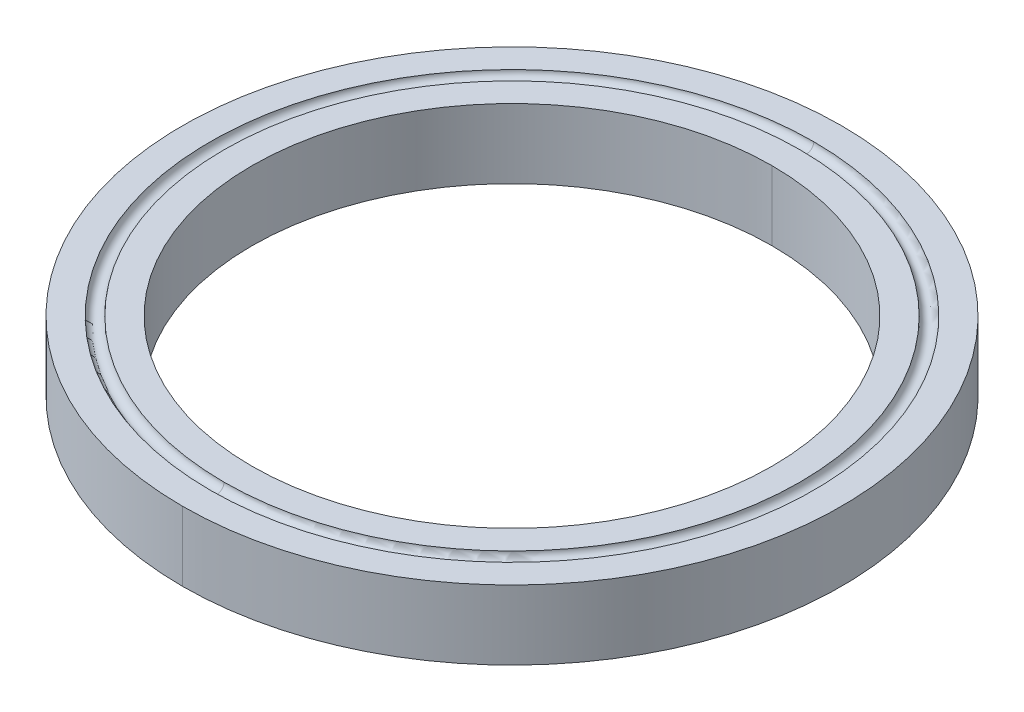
ISO-10303-21;
HEADER;
FILE_DESCRIPTION(('STEP AP214'),'2;1');
FILE_NAME('part.step','',(''),(''),'','','');
FILE_SCHEMA(('AUTOMOTIVE_DESIGN { 1 0 10303 214 1 1 1 1 }'));
ENDSEC;
DATA;
#1=APPLICATION_CONTEXT('core data for automotive mechanical design processes');
#2=APPLICATION_PROTOCOL_DEFINITION('international standard','automotive_design',2000,#1);
#3=PRODUCT_CONTEXT('',#1,'mechanical');
#4=PRODUCT('Part','Part','',(#3));
#5=PRODUCT_RELATED_PRODUCT_CATEGORY('part','',(#4));
#6=PRODUCT_DEFINITION_FORMATION('','',#4);
#7=PRODUCT_DEFINITION_CONTEXT('part definition',#1,'design');
#8=PRODUCT_DEFINITION('design','',#6,#7);
#9=PRODUCT_DEFINITION_SHAPE('','',#8);
#10=(LENGTH_UNIT() NAMED_UNIT(*) SI_UNIT(.MILLI.,.METRE.));
#11=(NAMED_UNIT(*) PLANE_ANGLE_UNIT() SI_UNIT($,.RADIAN.));
#12=(NAMED_UNIT(*) SI_UNIT($,.STERADIAN.) SOLID_ANGLE_UNIT());
#13=UNCERTAINTY_MEASURE_WITH_UNIT(LENGTH_MEASURE(1.E-05),#10,'distance_accuracy_value','');
#14=(GEOMETRIC_REPRESENTATION_CONTEXT(3) GLOBAL_UNCERTAINTY_ASSIGNED_CONTEXT((#13)) GLOBAL_UNIT_ASSIGNED_CONTEXT((#10,
#11,#12)) REPRESENTATION_CONTEXT('',''));
#15=CARTESIAN_POINT('',(0.,0.,0.));
#16=DIRECTION('',(0.,0.,1.));
#17=DIRECTION('',(1.,0.,0.));
#18=AXIS2_PLACEMENT_3D('',#15,#16,#17);
#19=CARTESIAN_POINT('',(43.5,0.,0.));
#20=DIRECTION('',(0.,-1.,0.));
#21=DIRECTION('',(0.,0.,-1.));
#22=AXIS2_PLACEMENT_3D('',#19,#20,#21);
#23=PLANE('',#22);
#24=CARTESIAN_POINT('',(0.,0.,0.));
#25=DIRECTION('',(0.,-1.,0.));
#26=DIRECTION('',(0.,0.,1.));
#27=AXIS2_PLACEMENT_3D('',#24,#25,#26);
#28=CIRCLE('',#27,43.5);
#29=CARTESIAN_POINT('',(0.,0.,43.5));
#30=VERTEX_POINT('',#29);
#31=CARTESIAN_POINT('',(0.,0.,-43.5));
#32=VERTEX_POINT('',#31);
#33=EDGE_CURVE('E11',#30,#32,#28,.T.);
#34=ORIENTED_EDGE('',*,*,#33,.T.);
#35=CARTESIAN_POINT('',(0.,0.,0.));
#36=DIRECTION('',(0.,-1.,0.));
#37=DIRECTION('',(0.,0.,-1.));
#38=AXIS2_PLACEMENT_3D('',#35,#36,#37);
#39=CIRCLE('',#38,43.5);
#40=EDGE_CURVE('E176',#32,#30,#39,.T.);
#41=ORIENTED_EDGE('',*,*,#40,.T.);
#42=EDGE_LOOP('',(#34,#41));
#43=FACE_BOUND('',#42,.T.);
#44=CARTESIAN_POINT('',(0.,0.,0.));
#45=DIRECTION('',(0.,1.,0.));
#46=DIRECTION('',(0.,0.,-1.));
#47=AXIS2_PLACEMENT_3D('',#44,#45,#46);
#48=CIRCLE('',#47,47.5);
#49=CARTESIAN_POINT('',(0.,0.,-47.5));
#50=VERTEX_POINT('',#49);
#51=CARTESIAN_POINT('',(0.,0.,47.5));
#52=VERTEX_POINT('',#51);
#53=EDGE_CURVE('E133',#50,#52,#48,.T.);
#54=ORIENTED_EDGE('',*,*,#53,.T.);
#55=CARTESIAN_POINT('',(0.,0.,0.));
#56=DIRECTION('',(0.,1.,0.));
#57=DIRECTION('',(0.,0.,1.));
#58=AXIS2_PLACEMENT_3D('',#55,#56,#57);
#59=CIRCLE('',#58,47.5);
#60=EDGE_CURVE('E136',#52,#50,#59,.T.);
#61=ORIENTED_EDGE('',*,*,#60,.T.);
#62=EDGE_LOOP('',(#54,#61));
#63=FACE_BOUND('',#62,.T.);
#64=ADVANCED_FACE('F17',(#43,#63),#23,.F.);
#65=CARTESIAN_POINT('',(0.,0.,0.));
#66=DIRECTION('',(0.,1.,0.));
#67=DIRECTION('',(0.,0.,1.));
#68=AXIS2_PLACEMENT_3D('',#65,#66,#67);
#69=TOROIDAL_SURFACE('',#68,42.5,1.);
#70=CARTESIAN_POINT('',(0.,0.,-42.5));
#71=DIRECTION('',(-1.,0.,0.));
#72=DIRECTION('',(0.,0.,-1.));
#73=AXIS2_PLACEMENT_3D('',#70,#71,#72);
#74=CIRCLE('',#73,1.);
#75=CARTESIAN_POINT('',(0.,0.,-41.5));
#76=VERTEX_POINT('',#75);
#77=EDGE_CURVE('E28',#32,#76,#74,.T.);
#78=ORIENTED_EDGE('',*,*,#77,.F.);
#79=ORIENTED_EDGE('',*,*,#33,.F.);
#80=CARTESIAN_POINT('',(0.,0.,42.5));
#81=DIRECTION('',(1.,0.,0.));
#82=DIRECTION('',(0.,0.,1.));
#83=AXIS2_PLACEMENT_3D('',#80,#81,#82);
#84=CIRCLE('',#83,1.);
#85=CARTESIAN_POINT('',(0.,0.,41.5));
#86=VERTEX_POINT('',#85);
#87=EDGE_CURVE('E167',#30,#86,#84,.T.);
#88=ORIENTED_EDGE('',*,*,#87,.T.);
#89=CARTESIAN_POINT('',(0.,0.,0.));
#90=DIRECTION('',(0.,1.,0.));
#91=DIRECTION('',(0.,0.,-1.));
#92=AXIS2_PLACEMENT_3D('',#89,#90,#91);
#93=CIRCLE('',#92,41.5);
#94=EDGE_CURVE('E106',#76,#86,#93,.T.);
#95=ORIENTED_EDGE('',*,*,#94,.F.);
#96=EDGE_LOOP('',(#78,#79,#88,#95));
#97=FACE_BOUND('',#96,.T.);
#98=ADVANCED_FACE('F221',(#97),#69,.F.);
#99=CARTESIAN_POINT('',(0.,0.,0.));
#100=DIRECTION('',(0.,1.,0.));
#101=DIRECTION('',(0.,0.,1.));
#102=AXIS2_PLACEMENT_3D('',#99,#100,#101);
#103=TOROIDAL_SURFACE('',#102,42.5,1.);
#104=CARTESIAN_POINT('',(0.,0.,0.));
#105=DIRECTION('',(0.,1.,0.));
#106=DIRECTION('',(0.,0.,1.));
#107=AXIS2_PLACEMENT_3D('',#104,#105,#106);
#108=CIRCLE('',#107,41.5);
#109=EDGE_CURVE('E147',#86,#76,#108,.T.);
#110=ORIENTED_EDGE('',*,*,#109,.F.);
#111=ORIENTED_EDGE('',*,*,#87,.F.);
#112=ORIENTED_EDGE('',*,*,#40,.F.);
#113=ORIENTED_EDGE('',*,*,#77,.T.);
#114=EDGE_LOOP('',(#110,#111,#112,#113));
#115=FACE_BOUND('',#114,.T.);
#116=ADVANCED_FACE('F226',(#115),#103,.F.);
#117=CARTESIAN_POINT('',(37.5,0.,0.));
#118=DIRECTION('',(0.,-1.,0.));
#119=DIRECTION('',(0.,0.,-1.));
#120=AXIS2_PLACEMENT_3D('',#117,#118,#119);
#121=PLANE('',#120);
#122=CARTESIAN_POINT('',(0.,0.,0.));
#123=DIRECTION('',(0.,-1.,0.));
#124=DIRECTION('',(0.,0.,1.));
#125=AXIS2_PLACEMENT_3D('',#122,#123,#124);
#126=CIRCLE('',#125,37.5);
#127=CARTESIAN_POINT('',(0.,0.,37.5));
#128=VERTEX_POINT('',#127);
#129=CARTESIAN_POINT('',(0.,0.,-37.5));
#130=VERTEX_POINT('',#129);
#131=EDGE_CURVE('E97',#128,#130,#126,.T.);
#132=ORIENTED_EDGE('',*,*,#131,.T.);
#133=CARTESIAN_POINT('',(0.,0.,0.));
#134=DIRECTION('',(0.,-1.,0.));
#135=DIRECTION('',(0.,0.,-1.));
#136=AXIS2_PLACEMENT_3D('',#133,#134,#135);
#137=CIRCLE('',#136,37.5);
#138=EDGE_CURVE('E102',#130,#128,#137,.T.);
#139=ORIENTED_EDGE('',*,*,#138,.T.);
#140=EDGE_LOOP('',(#132,#139));
#141=FACE_BOUND('',#140,.T.);
#142=ORIENTED_EDGE('',*,*,#94,.T.);
#143=ORIENTED_EDGE('',*,*,#109,.T.);
#144=EDGE_LOOP('',(#142,#143));
#145=FACE_BOUND('',#144,.T.);
#146=ADVANCED_FACE('F99',(#141,#145),#121,.F.);
#147=CARTESIAN_POINT('',(0.,0.,0.));
#148=DIRECTION('',(0.,1.,0.));
#149=DIRECTION('',(0.,0.,1.));
#150=AXIS2_PLACEMENT_3D('',#147,#148,#149);
#151=CYLINDRICAL_SURFACE('',#150,37.5);
#152=DIRECTION('',(0.,-1.,0.));
#153=VECTOR('',#152,1.);
#154=CARTESIAN_POINT('',(0.,0.,-37.5));
#155=LINE('',#154,#153);
#156=CARTESIAN_POINT('',(0.,-10.,-37.5));
#157=VERTEX_POINT('',#156);
#158=EDGE_CURVE('E107',#130,#157,#155,.T.);
#159=ORIENTED_EDGE('',*,*,#158,.F.);
#160=ORIENTED_EDGE('',*,*,#131,.F.);
#161=DIRECTION('',(0.,-1.,0.));
#162=VECTOR('',#161,1.);
#163=CARTESIAN_POINT('',(0.,0.,37.5));
#164=LINE('',#163,#162);
#165=CARTESIAN_POINT('',(0.,-10.,37.5));
#166=VERTEX_POINT('',#165);
#167=EDGE_CURVE('E21',#128,#166,#164,.T.);
#168=ORIENTED_EDGE('',*,*,#167,.T.);
#169=CARTESIAN_POINT('',(0.,-10.,0.));
#170=DIRECTION('',(0.,1.,0.));
#171=DIRECTION('',(0.,0.,-1.));
#172=AXIS2_PLACEMENT_3D('',#169,#170,#171);
#173=CIRCLE('',#172,37.5);
#174=EDGE_CURVE('E113',#157,#166,#173,.T.);
#175=ORIENTED_EDGE('',*,*,#174,.F.);
#176=EDGE_LOOP('',(#159,#160,#168,#175));
#177=FACE_BOUND('',#176,.T.);
#178=ADVANCED_FACE('F111',(#177),#151,.F.);
#179=CARTESIAN_POINT('',(0.,0.,0.));
#180=DIRECTION('',(0.,1.,0.));
#181=DIRECTION('',(0.,0.,1.));
#182=AXIS2_PLACEMENT_3D('',#179,#180,#181);
#183=CYLINDRICAL_SURFACE('',#182,37.5);
#184=CARTESIAN_POINT('',(0.,-10.,0.));
#185=DIRECTION('',(0.,1.,0.));
#186=DIRECTION('',(0.,0.,1.));
#187=AXIS2_PLACEMENT_3D('',#184,#185,#186);
#188=CIRCLE('',#187,37.5);
#189=EDGE_CURVE('E125',#166,#157,#188,.T.);
#190=ORIENTED_EDGE('',*,*,#189,.F.);
#191=ORIENTED_EDGE('',*,*,#167,.F.);
#192=ORIENTED_EDGE('',*,*,#138,.F.);
#193=ORIENTED_EDGE('',*,*,#158,.T.);
#194=EDGE_LOOP('',(#190,#191,#192,#193));
#195=FACE_BOUND('',#194,.T.);
#196=ADVANCED_FACE('F119',(#195),#183,.F.);
#197=CARTESIAN_POINT('',(41.5,-10.,0.));
#198=DIRECTION('',(0.,1.,0.));
#199=DIRECTION('',(1.,0.,0.));
#200=AXIS2_PLACEMENT_3D('',#197,#198,#199);
#201=PLANE('',#200);
#202=ORIENTED_EDGE('',*,*,#174,.T.);
#203=ORIENTED_EDGE('',*,*,#189,.T.);
#204=EDGE_LOOP('',(#202,#203));
#205=FACE_BOUND('',#204,.T.);
#206=CARTESIAN_POINT('',(0.,-10.,0.));
#207=DIRECTION('',(0.,-1.,0.));
#208=DIRECTION('',(0.,0.,1.));
#209=AXIS2_PLACEMENT_3D('',#206,#207,#208);
#210=CIRCLE('',#209,41.5);
#211=CARTESIAN_POINT('',(0.,-10.,41.5));
#212=VERTEX_POINT('',#211);
#213=CARTESIAN_POINT('',(0.,-10.,-41.5));
#214=VERTEX_POINT('',#213);
#215=EDGE_CURVE('E127',#212,#214,#210,.T.);
#216=ORIENTED_EDGE('',*,*,#215,.T.);
#217=CARTESIAN_POINT('',(0.,-10.,0.));
#218=DIRECTION('',(0.,-1.,0.));
#219=DIRECTION('',(0.,0.,-1.));
#220=AXIS2_PLACEMENT_3D('',#217,#218,#219);
#221=CIRCLE('',#220,41.5);
#222=EDGE_CURVE('E148',#214,#212,#221,.T.);
#223=ORIENTED_EDGE('',*,*,#222,.T.);
#224=EDGE_LOOP('',(#216,#223));
#225=FACE_BOUND('',#224,.T.);
#226=ADVANCED_FACE('F198',(#205,#225),#201,.F.);
#227=CARTESIAN_POINT('',(0.,-10.,0.));
#228=DIRECTION('',(0.,1.,0.));
#229=DIRECTION('',(0.,0.,1.));
#230=AXIS2_PLACEMENT_3D('',#227,#228,#229);
#231=TOROIDAL_SURFACE('',#230,42.5,1.);
#232=CARTESIAN_POINT('',(0.,-10.,-42.5));
#233=DIRECTION('',(-1.,0.,0.));
#234=DIRECTION('',(0.,0.,1.));
#235=AXIS2_PLACEMENT_3D('',#232,#233,#234);
#236=CIRCLE('',#235,1.);
#237=CARTESIAN_POINT('',(0.,-10.,-43.5));
#238=VERTEX_POINT('',#237);
#239=EDGE_CURVE('E152',#214,#238,#236,.T.);
#240=ORIENTED_EDGE('',*,*,#239,.F.);
#241=ORIENTED_EDGE('',*,*,#215,.F.);
#242=CARTESIAN_POINT('',(0.,-10.,42.5));
#243=DIRECTION('',(1.,0.,0.));
#244=DIRECTION('',(0.,0.,-1.));
#245=AXIS2_PLACEMENT_3D('',#242,#243,#244);
#246=CIRCLE('',#245,1.);
#247=CARTESIAN_POINT('',(0.,-10.,43.5));
#248=VERTEX_POINT('',#247);
#249=EDGE_CURVE('E153',#212,#248,#246,.T.);
#250=ORIENTED_EDGE('',*,*,#249,.T.);
#251=CARTESIAN_POINT('',(0.,-10.,0.));
#252=DIRECTION('',(0.,1.,0.));
#253=DIRECTION('',(0.,0.,-1.));
#254=AXIS2_PLACEMENT_3D('',#251,#252,#253);
#255=CIRCLE('',#254,43.5);
#256=EDGE_CURVE('E154',#238,#248,#255,.T.);
#257=ORIENTED_EDGE('',*,*,#256,.F.);
#258=EDGE_LOOP('',(#240,#241,#250,#257));
#259=FACE_BOUND('',#258,.T.);
#260=ADVANCED_FACE('F203',(#259),#231,.F.);
#261=CARTESIAN_POINT('',(0.,-10.,0.));
#262=DIRECTION('',(0.,1.,0.));
#263=DIRECTION('',(0.,0.,1.));
#264=AXIS2_PLACEMENT_3D('',#261,#262,#263);
#265=TOROIDAL_SURFACE('',#264,42.5,1.);
#266=CARTESIAN_POINT('',(0.,-10.,0.));
#267=DIRECTION('',(0.,1.,0.));
#268=DIRECTION('',(0.,0.,1.));
#269=AXIS2_PLACEMENT_3D('',#266,#267,#268);
#270=CIRCLE('',#269,43.5);
#271=EDGE_CURVE('E158',#248,#238,#270,.T.);
#272=ORIENTED_EDGE('',*,*,#271,.F.);
#273=ORIENTED_EDGE('',*,*,#249,.F.);
#274=ORIENTED_EDGE('',*,*,#222,.F.);
#275=ORIENTED_EDGE('',*,*,#239,.T.);
#276=EDGE_LOOP('',(#272,#273,#274,#275));
#277=FACE_BOUND('',#276,.T.);
#278=ADVANCED_FACE('F206',(#277),#265,.F.);
#279=CARTESIAN_POINT('',(47.5,-10.,0.));
#280=DIRECTION('',(0.,1.,0.));
#281=DIRECTION('',(1.,0.,0.));
#282=AXIS2_PLACEMENT_3D('',#279,#280,#281);
#283=PLANE('',#282);
#284=ORIENTED_EDGE('',*,*,#256,.T.);
#285=ORIENTED_EDGE('',*,*,#271,.T.);
#286=EDGE_LOOP('',(#284,#285));
#287=FACE_BOUND('',#286,.T.);
#288=CARTESIAN_POINT('',(0.,-10.,0.));
#289=DIRECTION('',(0.,-1.,0.));
#290=DIRECTION('',(0.,0.,1.));
#291=AXIS2_PLACEMENT_3D('',#288,#289,#290);
#292=CIRCLE('',#291,47.5);
#293=CARTESIAN_POINT('',(0.,-10.,47.5));
#294=VERTEX_POINT('',#293);
#295=CARTESIAN_POINT('',(0.,-10.,-47.5));
#296=VERTEX_POINT('',#295);
#297=EDGE_CURVE('E134',#294,#296,#292,.T.);
#298=ORIENTED_EDGE('',*,*,#297,.T.);
#299=CARTESIAN_POINT('',(0.,-10.,0.));
#300=DIRECTION('',(0.,-1.,0.));
#301=DIRECTION('',(0.,0.,-1.));
#302=AXIS2_PLACEMENT_3D('',#299,#300,#301);
#303=CIRCLE('',#302,47.5);
#304=EDGE_CURVE('E139',#296,#294,#303,.T.);
#305=ORIENTED_EDGE('',*,*,#304,.T.);
#306=EDGE_LOOP('',(#298,#305));
#307=FACE_BOUND('',#306,.T.);
#308=ADVANCED_FACE('F208',(#287,#307),#283,.F.);
#309=CARTESIAN_POINT('',(0.,0.,0.));
#310=DIRECTION('',(0.,1.,0.));
#311=DIRECTION('',(0.,0.,1.));
#312=AXIS2_PLACEMENT_3D('',#309,#310,#311);
#313=CYLINDRICAL_SURFACE('',#312,47.5);
#314=DIRECTION('',(0.,-1.,0.));
#315=VECTOR('',#314,1.);
#316=CARTESIAN_POINT('',(0.,0.,-47.5));
#317=LINE('',#316,#315);
#318=EDGE_CURVE('E140',#50,#296,#317,.T.);
#319=ORIENTED_EDGE('',*,*,#318,.F.);
#320=ORIENTED_EDGE('',*,*,#60,.F.);
#321=DIRECTION('',(0.,-1.,0.));
#322=VECTOR('',#321,1.);
#323=CARTESIAN_POINT('',(0.,0.,47.5));
#324=LINE('',#323,#322);
#325=EDGE_CURVE('E130',#52,#294,#324,.T.);
#326=ORIENTED_EDGE('',*,*,#325,.T.);
#327=ORIENTED_EDGE('',*,*,#304,.F.);
#328=EDGE_LOOP('',(#319,#320,#326,#327));
#329=FACE_BOUND('',#328,.T.);
#330=ADVANCED_FACE('F211',(#329),#313,.T.);
#331=CARTESIAN_POINT('',(0.,0.,0.));
#332=DIRECTION('',(0.,1.,0.));
#333=DIRECTION('',(0.,0.,1.));
#334=AXIS2_PLACEMENT_3D('',#331,#332,#333);
#335=CYLINDRICAL_SURFACE('',#334,47.5);
#336=ORIENTED_EDGE('',*,*,#297,.F.);
#337=ORIENTED_EDGE('',*,*,#325,.F.);
#338=ORIENTED_EDGE('',*,*,#53,.F.);
#339=ORIENTED_EDGE('',*,*,#318,.T.);
#340=EDGE_LOOP('',(#336,#337,#338,#339));
#341=FACE_BOUND('',#340,.T.);
#342=ADVANCED_FACE('F19',(#341),#335,.T.);
#343=CLOSED_SHELL('',(#64,#98,#116,#146,#178,#196,#226,#260,#278,#308,#330,#342));
#344=MANIFOLD_SOLID_BREP('B1',#343);
#345=ADVANCED_BREP_SHAPE_REPRESENTATION('',(#18,#344),#14);
#346=SHAPE_DEFINITION_REPRESENTATION(#9,#345);
ENDSEC;
END-ISO-10303-21;
